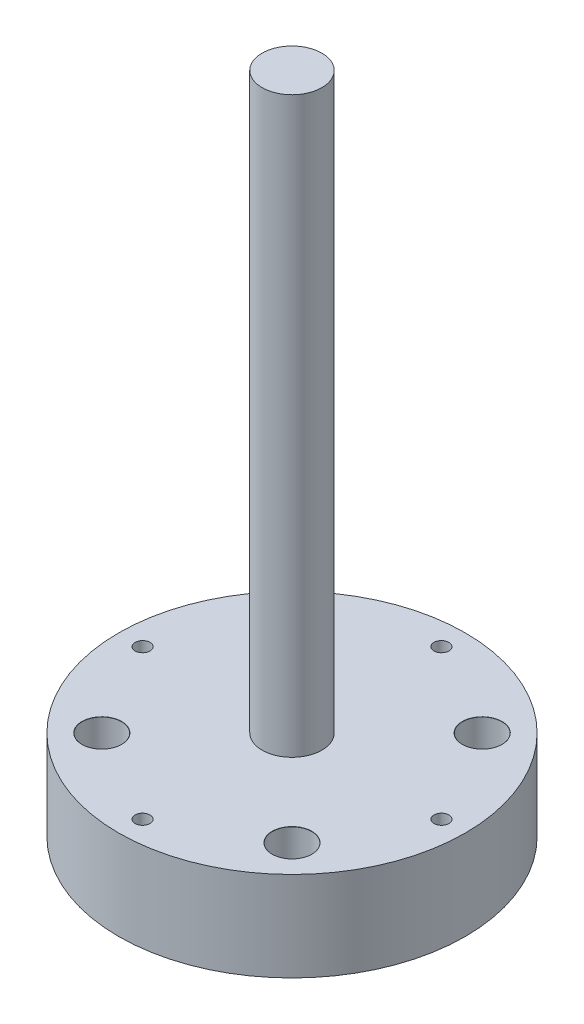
ISO-10303-21;
HEADER;
FILE_DESCRIPTION(('STEP AP214'),'2;1');
FILE_NAME('part.step','',(''),(''),'','','');
FILE_SCHEMA(('AUTOMOTIVE_DESIGN { 1 0 10303 214 1 1 1 1 }'));
ENDSEC;
DATA;
#1=APPLICATION_CONTEXT('core data for automotive mechanical design processes');
#2=APPLICATION_PROTOCOL_DEFINITION('international standard','automotive_design',2000,#1);
#3=PRODUCT_CONTEXT('',#1,'mechanical');
#4=PRODUCT('Part','Part','',(#3));
#5=PRODUCT_RELATED_PRODUCT_CATEGORY('part','',(#4));
#6=PRODUCT_DEFINITION_FORMATION('','',#4);
#7=PRODUCT_DEFINITION_CONTEXT('part definition',#1,'design');
#8=PRODUCT_DEFINITION('design','',#6,#7);
#9=PRODUCT_DEFINITION_SHAPE('','',#8);
#10=(LENGTH_UNIT() NAMED_UNIT(*) SI_UNIT(.MILLI.,.METRE.));
#11=(NAMED_UNIT(*) PLANE_ANGLE_UNIT() SI_UNIT($,.RADIAN.));
#12=(NAMED_UNIT(*) SI_UNIT($,.STERADIAN.) SOLID_ANGLE_UNIT());
#13=UNCERTAINTY_MEASURE_WITH_UNIT(LENGTH_MEASURE(1.E-05),#10,'distance_accuracy_value','');
#14=(GEOMETRIC_REPRESENTATION_CONTEXT(3) GLOBAL_UNCERTAINTY_ASSIGNED_CONTEXT((#13)) GLOBAL_UNIT_ASSIGNED_CONTEXT((#10,
#11,#12)) REPRESENTATION_CONTEXT('',''));
#15=CARTESIAN_POINT('',(0.,0.,0.));
#16=DIRECTION('',(0.,0.,1.));
#17=DIRECTION('',(1.,0.,0.));
#18=AXIS2_PLACEMENT_3D('',#15,#16,#17);
#19=CARTESIAN_POINT('',(0.,0.,0.));
#20=DIRECTION('',(0.,-1.,0.));
#21=DIRECTION('',(0.,0.,-1.));
#22=AXIS2_PLACEMENT_3D('',#19,#20,#21);
#23=CYLINDRICAL_SURFACE('',#22,21.);
#24=DIRECTION('',(0.,-1.,0.));
#25=VECTOR('',#24,1.);
#26=CARTESIAN_POINT('',(-10.8213564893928,4.4125,17.9971732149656));
#27=LINE('',#26,#25);
#28=CARTESIAN_POINT('',(-10.8213564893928,2.,17.9971732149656));
#29=VERTEX_POINT('',#28);
#30=CARTESIAN_POINT('',(-10.8213564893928,0.0250000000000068,17.9971732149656));
#31=VERTEX_POINT('',#30);
#32=EDGE_CURVE('E25',#29,#31,#27,.T.);
#33=ORIENTED_EDGE('',*,*,#32,.F.);
#34=CARTESIAN_POINT('',(0.,2.,0.));
#35=DIRECTION('',(0.,-1.,0.));
#36=DIRECTION('',(0.,0.,-1.));
#37=AXIS2_PLACEMENT_3D('',#34,#35,#36);
#38=CIRCLE('',#37,21.);
#39=CARTESIAN_POINT('',(10.8213564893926,2.,17.9971732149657));
#40=VERTEX_POINT('',#39);
#41=EDGE_CURVE('E255',#40,#29,#38,.T.);
#42=ORIENTED_EDGE('',*,*,#41,.F.);
#43=DIRECTION('',(0.,-1.,0.));
#44=VECTOR('',#43,1.);
#45=CARTESIAN_POINT('',(10.8213564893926,4.4125,17.9971732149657));
#46=LINE('',#45,#44);
#47=CARTESIAN_POINT('',(10.8213564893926,0.0250000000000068,17.9971732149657));
#48=VERTEX_POINT('',#47);
#49=EDGE_CURVE('E220',#48,#40,#46,.F.);
#50=ORIENTED_EDGE('',*,*,#49,.F.);
#51=CARTESIAN_POINT('',(10.7995028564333,-0.000200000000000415,18.0102953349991));
#52=CARTESIAN_POINT('',(10.8031751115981,0.00403364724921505,18.0080933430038));
#53=CARTESIAN_POINT('',(10.8068468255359,0.0082671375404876,18.005890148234));
#54=CARTESIAN_POINT('',(10.8141891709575,0.0167338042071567,18.0014813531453));
#55=CARTESIAN_POINT('',(10.8178598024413,0.0209669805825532,17.9992757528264));
#56=CARTESIAN_POINT('',(10.821529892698,0.0252000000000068,17.997068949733));
#57=B_SPLINE_CURVE_WITH_KNOTS('',3,(#51,#52,#53,#54,#55,#56),.UNSPECIFIED.,.F.,.F.,(4,2,4),(0.,
0.0180643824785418,0.0361287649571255),.UNSPECIFIED.);
#58=CARTESIAN_POINT('',(10.7996763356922,0.,18.0101913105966));
#59=VERTEX_POINT('',#58);
#60=EDGE_CURVE('E233',#59,#48,#57,.T.);
#61=ORIENTED_EDGE('',*,*,#60,.F.);
#62=CARTESIAN_POINT('',(0.,0.,0.));
#63=DIRECTION('',(0.,-1.,0.));
#64=DIRECTION('',(0.,0.,-1.));
#65=AXIS2_PLACEMENT_3D('',#62,#63,#64);
#66=CIRCLE('',#65,21.);
#67=CARTESIAN_POINT('',(-10.7996763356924,0.,18.0101913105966));
#68=VERTEX_POINT('',#67);
#69=EDGE_CURVE('E123',#59,#68,#66,.T.);
#70=ORIENTED_EDGE('',*,*,#69,.T.);
#71=CARTESIAN_POINT('',(-10.8215298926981,0.0251999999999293,17.9970689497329));
#72=CARTESIAN_POINT('',(-10.8178598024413,0.0209669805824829,17.9992757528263));
#73=CARTESIAN_POINT('',(-10.8141891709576,0.0167338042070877,18.0014813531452));
#74=CARTESIAN_POINT('',(-10.806846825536,0.00826713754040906,18.0058901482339));
#75=CARTESIAN_POINT('',(-10.8031751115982,0.00403364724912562,18.0080933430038));
#76=CARTESIAN_POINT('',(-10.7995028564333,-0.000200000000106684,18.010295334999));
#77=B_SPLINE_CURVE_WITH_KNOTS('',3,(#71,#72,#73,#74,#75,#76),.UNSPECIFIED.,.F.,.F.,(4,2,4),(0.,
0.0180643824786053,0.0361287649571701),.UNSPECIFIED.);
#78=EDGE_CURVE('E115',#31,#68,#77,.T.);
#79=ORIENTED_EDGE('',*,*,#78,.F.);
#80=EDGE_LOOP('',(#33,#42,#50,#61,#70,#79));
#81=FACE_BOUND('',#80,.T.);
#82=ADVANCED_FACE('F16',(#81),#23,.F.);
#83=DIRECTION('',(0.,-1.,0.));
#84=VECTOR('',#83,1.);
#85=CARTESIAN_POINT('',(10.8213564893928,4.4125,-17.9971732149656));
#86=LINE('',#85,#84);
#87=CARTESIAN_POINT('',(10.8213564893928,2.,-17.9971732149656));
#88=VERTEX_POINT('',#87);
#89=CARTESIAN_POINT('',(10.8213564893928,0.0250000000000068,-17.9971732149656));
#90=VERTEX_POINT('',#89);
#91=EDGE_CURVE('E148',#88,#90,#86,.T.);
#92=ORIENTED_EDGE('',*,*,#91,.F.);
#93=CARTESIAN_POINT('',(-10.8213564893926,2.,-17.9971732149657));
#94=VERTEX_POINT('',#93);
#95=EDGE_CURVE('E258',#94,#88,#38,.T.);
#96=ORIENTED_EDGE('',*,*,#95,.F.);
#97=DIRECTION('',(0.,-1.,0.));
#98=VECTOR('',#97,1.);
#99=CARTESIAN_POINT('',(-10.8213564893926,4.4125,-17.9971732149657));
#100=LINE('',#99,#98);
#101=CARTESIAN_POINT('',(-10.8213564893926,0.0250000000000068,-17.9971732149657));
#102=VERTEX_POINT('',#101);
#103=EDGE_CURVE('E188',#102,#94,#100,.F.);
#104=ORIENTED_EDGE('',*,*,#103,.F.);
#105=CARTESIAN_POINT('',(-10.7995028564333,-0.000200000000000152,-18.0102953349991));
#106=CARTESIAN_POINT('',(-10.8031751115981,0.00403364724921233,-18.0080933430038));
#107=CARTESIAN_POINT('',(-10.8068468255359,0.0082671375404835,-18.005890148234));
#108=CARTESIAN_POINT('',(-10.8141891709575,0.0167338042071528,-18.0014813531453));
#109=CARTESIAN_POINT('',(-10.8178598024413,0.0209669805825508,-17.9992757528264));
#110=CARTESIAN_POINT('',(-10.821529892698,0.0252000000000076,-17.997068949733));
#111=B_SPLINE_CURVE_WITH_KNOTS('',3,(#105,#106,#107,#108,#109,#110),.UNSPECIFIED.,.F.,.F.,(4,2,
4),(0.,0.0180643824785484,0.0361287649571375),.UNSPECIFIED.);
#112=CARTESIAN_POINT('',(-10.7996763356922,0.,-18.0101913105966));
#113=VERTEX_POINT('',#112);
#114=EDGE_CURVE('E201',#113,#102,#111,.T.);
#115=ORIENTED_EDGE('',*,*,#114,.F.);
#116=CARTESIAN_POINT('',(10.7996763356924,0.,-18.0101913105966));
#117=VERTEX_POINT('',#116);
#118=EDGE_CURVE('E241',#113,#117,#66,.T.);
#119=ORIENTED_EDGE('',*,*,#118,.T.);
#120=CARTESIAN_POINT('',(10.8215298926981,0.0251999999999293,-17.9970689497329));
#121=CARTESIAN_POINT('',(10.8178598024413,0.0209669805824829,-17.9992757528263));
#122=CARTESIAN_POINT('',(10.8141891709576,0.0167338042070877,-18.0014813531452));
#123=CARTESIAN_POINT('',(10.806846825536,0.00826713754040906,-18.0058901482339));
#124=CARTESIAN_POINT('',(10.8031751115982,0.00403364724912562,-18.0080933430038));
#125=CARTESIAN_POINT('',(10.7995028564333,-0.000200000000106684,-18.010295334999));
#126=B_SPLINE_CURVE_WITH_KNOTS('',3,(#120,#121,#122,#123,#124,#125),.UNSPECIFIED.,.F.,.F.,(4,2,
4),(0.,0.0180643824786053,0.0361287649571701),.UNSPECIFIED.);
#127=EDGE_CURVE('E150',#90,#117,#126,.T.);
#128=ORIENTED_EDGE('',*,*,#127,.F.);
#129=EDGE_LOOP('',(#92,#96,#104,#115,#119,#128));
#130=FACE_BOUND('',#129,.T.);
#131=ADVANCED_FACE('F388',(#130),#23,.F.);
#132=DIRECTION('',(0.,-1.,0.));
#133=VECTOR('',#132,1.);
#134=CARTESIAN_POINT('',(-17.9971732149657,4.4125,10.8213564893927));
#135=LINE('',#134,#133);
#136=CARTESIAN_POINT('',(-17.9971732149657,0.0250000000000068,10.8213564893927));
#137=VERTEX_POINT('',#136);
#138=CARTESIAN_POINT('',(-17.9971732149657,2.,10.8213564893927));
#139=VERTEX_POINT('',#138);
#140=EDGE_CURVE('E124',#137,#139,#135,.F.);
#141=ORIENTED_EDGE('',*,*,#140,.F.);
#142=CARTESIAN_POINT('',(-18.010295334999,-0.000200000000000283,10.7995028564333));
#143=CARTESIAN_POINT('',(-18.0080933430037,0.00403364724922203,10.8031751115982));
#144=CARTESIAN_POINT('',(-18.0058901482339,0.00826713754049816,10.806846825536));
#145=CARTESIAN_POINT('',(-18.0014813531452,0.0167338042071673,10.8141891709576));
#146=CARTESIAN_POINT('',(-17.9992757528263,0.0209669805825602,10.8178598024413));
#147=CARTESIAN_POINT('',(-17.9970689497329,0.025200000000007,10.8215298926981));
#148=B_SPLINE_CURVE_WITH_KNOTS('',3,(#142,#143,#144,#145,#146,#147),.UNSPECIFIED.,.F.,.F.,(4,2,
4),(0.,0.0180643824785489,0.0361287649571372),.UNSPECIFIED.);
#149=CARTESIAN_POINT('',(-18.0101913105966,0.,10.7996763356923));
#150=VERTEX_POINT('',#149);
#151=EDGE_CURVE('E117',#150,#137,#148,.T.);
#152=ORIENTED_EDGE('',*,*,#151,.F.);
#153=CARTESIAN_POINT('',(-18.0101913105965,0.,-10.7996763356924));
#154=VERTEX_POINT('',#153);
#155=EDGE_CURVE('E240',#150,#154,#66,.T.);
#156=ORIENTED_EDGE('',*,*,#155,.T.);
#157=CARTESIAN_POINT('',(-17.9970689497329,0.0251999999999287,-10.8215298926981));
#158=CARTESIAN_POINT('',(-17.9992757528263,0.0209669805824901,-10.8178598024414));
#159=CARTESIAN_POINT('',(-18.0014813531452,0.0167338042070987,-10.8141891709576));
#160=CARTESIAN_POINT('',(-18.0058901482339,0.00826713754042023,-10.806846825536));
#161=CARTESIAN_POINT('',(-18.0080933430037,0.00403364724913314,-10.8031751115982));
#162=CARTESIAN_POINT('',(-18.010295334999,-0.000200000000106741,-10.7995028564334));
#163=B_SPLINE_CURVE_WITH_KNOTS('',3,(#157,#158,#159,#160,#161,#162),.UNSPECIFIED.,.F.,.F.,(4,2,
4),(0.,0.0180643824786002,0.0361287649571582),.UNSPECIFIED.);
#164=CARTESIAN_POINT('',(-17.9971732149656,0.0250000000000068,-10.8213564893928));
#165=VERTEX_POINT('',#164);
#166=EDGE_CURVE('E180',#165,#154,#163,.T.);
#167=ORIENTED_EDGE('',*,*,#166,.F.);
#168=DIRECTION('',(0.,-1.,0.));
#169=VECTOR('',#168,1.);
#170=CARTESIAN_POINT('',(-17.9971732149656,4.4125,-10.8213564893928));
#171=LINE('',#170,#169);
#172=CARTESIAN_POINT('',(-17.9971732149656,2.,-10.8213564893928));
#173=VERTEX_POINT('',#172);
#174=EDGE_CURVE('E178',#173,#165,#171,.T.);
#175=ORIENTED_EDGE('',*,*,#174,.F.);
#176=EDGE_CURVE('E257',#139,#173,#38,.T.);
#177=ORIENTED_EDGE('',*,*,#176,.F.);
#178=EDGE_LOOP('',(#141,#152,#156,#167,#175,#177));
#179=FACE_BOUND('',#178,.T.);
#180=ADVANCED_FACE('F393',(#179),#23,.F.);
#181=DIRECTION('',(0.,-1.,0.));
#182=VECTOR('',#181,1.);
#183=CARTESIAN_POINT('',(17.9971732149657,4.4125,-10.8213564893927));
#184=LINE('',#183,#182);
#185=CARTESIAN_POINT('',(17.9971732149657,0.0250000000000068,-10.8213564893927));
#186=VERTEX_POINT('',#185);
#187=CARTESIAN_POINT('',(17.9971732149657,2.,-10.8213564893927));
#188=VERTEX_POINT('',#187);
#189=EDGE_CURVE('E157',#186,#188,#184,.F.);
#190=ORIENTED_EDGE('',*,*,#189,.F.);
#191=CARTESIAN_POINT('',(18.010295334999,-0.000200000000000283,-10.7995028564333));
#192=CARTESIAN_POINT('',(18.0080933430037,0.00403364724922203,-10.8031751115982));
#193=CARTESIAN_POINT('',(18.0058901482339,0.00826713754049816,-10.806846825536));
#194=CARTESIAN_POINT('',(18.0014813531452,0.0167338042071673,-10.8141891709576));
#195=CARTESIAN_POINT('',(17.9992757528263,0.0209669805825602,-10.8178598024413));
#196=CARTESIAN_POINT('',(17.9970689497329,0.025200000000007,-10.8215298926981));
#197=B_SPLINE_CURVE_WITH_KNOTS('',3,(#191,#192,#193,#194,#195,#196),.UNSPECIFIED.,.F.,.F.,(4,2,
4),(0.,0.0180643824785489,0.0361287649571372),.UNSPECIFIED.);
#198=CARTESIAN_POINT('',(18.0101913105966,0.,-10.7996763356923));
#199=VERTEX_POINT('',#198);
#200=EDGE_CURVE('E169',#199,#186,#197,.T.);
#201=ORIENTED_EDGE('',*,*,#200,.F.);
#202=CARTESIAN_POINT('',(18.0101913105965,0.,10.7996763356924));
#203=VERTEX_POINT('',#202);
#204=EDGE_CURVE('E245',#199,#203,#66,.T.);
#205=ORIENTED_EDGE('',*,*,#204,.T.);
#206=CARTESIAN_POINT('',(17.9970689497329,0.0251999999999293,10.8215298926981));
#207=CARTESIAN_POINT('',(17.9992757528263,0.0209669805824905,10.8178598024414));
#208=CARTESIAN_POINT('',(18.0014813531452,0.0167338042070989,10.8141891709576));
#209=CARTESIAN_POINT('',(18.0058901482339,0.00826713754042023,10.806846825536));
#210=CARTESIAN_POINT('',(18.0080933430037,0.00403364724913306,10.8031751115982));
#211=CARTESIAN_POINT('',(18.010295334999,-0.000200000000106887,10.7995028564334));
#212=B_SPLINE_CURVE_WITH_KNOTS('',3,(#206,#207,#208,#209,#210,#211),.UNSPECIFIED.,.F.,.F.,(4,2,
4),(0.,0.0180643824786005,0.0361287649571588),.UNSPECIFIED.);
#213=CARTESIAN_POINT('',(17.9971732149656,0.0250000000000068,10.8213564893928));
#214=VERTEX_POINT('',#213);
#215=EDGE_CURVE('E212',#214,#203,#212,.T.);
#216=ORIENTED_EDGE('',*,*,#215,.F.);
#217=DIRECTION('',(0.,-1.,0.));
#218=VECTOR('',#217,1.);
#219=CARTESIAN_POINT('',(17.9971732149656,4.4125,10.8213564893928));
#220=LINE('',#219,#218);
#221=CARTESIAN_POINT('',(17.9971732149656,2.,10.8213564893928));
#222=VERTEX_POINT('',#221);
#223=EDGE_CURVE('E210',#222,#214,#220,.T.);
#224=ORIENTED_EDGE('',*,*,#223,.F.);
#225=EDGE_CURVE('E262',#188,#222,#38,.T.);
#226=ORIENTED_EDGE('',*,*,#225,.F.);
#227=EDGE_LOOP('',(#190,#201,#205,#216,#224,#226));
#228=FACE_BOUND('',#227,.T.);
#229=ADVANCED_FACE('F18',(#228),#23,.F.);
#230=CARTESIAN_POINT('',(21.,0.,0.));
#231=DIRECTION('',(0.,-1.,0.));
#232=DIRECTION('',(0.,0.,-1.));
#233=AXIS2_PLACEMENT_3D('',#230,#231,#232);
#234=PLANE('',#233);
#235=CARTESIAN_POINT('',(0.,0.,25.));
#236=DIRECTION('',(0.,-1.,0.));
#237=DIRECTION('',(0.,0.,-1.));
#238=AXIS2_PLACEMENT_3D('',#235,#236,#237);
#239=CIRCLE('',#238,1.25);
#240=CARTESIAN_POINT('',(0.,0.,23.75));
#241=VERTEX_POINT('',#240);
#242=EDGE_CURVE('E355',#241,#241,#239,.T.);
#243=ORIENTED_EDGE('',*,*,#242,.F.);
#244=EDGE_LOOP('',(#243));
#245=FACE_BOUND('',#244,.T.);
#246=CARTESIAN_POINT('',(0.,0.,-25.));
#247=DIRECTION('',(0.,-1.,0.));
#248=DIRECTION('',(0.,0.,-1.));
#249=AXIS2_PLACEMENT_3D('',#246,#247,#248);
#250=CIRCLE('',#249,1.25);
#251=CARTESIAN_POINT('',(0.,0.,-26.25));
#252=VERTEX_POINT('',#251);
#253=EDGE_CURVE('E349',#252,#252,#250,.T.);
#254=ORIENTED_EDGE('',*,*,#253,.F.);
#255=EDGE_LOOP('',(#254));
#256=FACE_BOUND('',#255,.T.);
#257=CARTESIAN_POINT('',(-25.,0.,0.));
#258=DIRECTION('',(0.,-1.,0.));
#259=DIRECTION('',(0.,0.,-1.));
#260=AXIS2_PLACEMENT_3D('',#257,#258,#259);
#261=CIRCLE('',#260,1.25);
#262=CARTESIAN_POINT('',(-25.,0.,-1.25));
#263=VERTEX_POINT('',#262);
#264=EDGE_CURVE('E343',#263,#263,#261,.T.);
#265=ORIENTED_EDGE('',*,*,#264,.F.);
#266=EDGE_LOOP('',(#265));
#267=FACE_BOUND('',#266,.T.);
#268=CARTESIAN_POINT('',(25.,0.,0.));
#269=DIRECTION('',(0.,-1.,0.));
#270=DIRECTION('',(0.,0.,-1.));
#271=AXIS2_PLACEMENT_3D('',#268,#269,#270);
#272=CIRCLE('',#271,1.25);
#273=CARTESIAN_POINT('',(25.,0.,-1.24999999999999));
#274=VERTEX_POINT('',#273);
#275=EDGE_CURVE('E337',#274,#274,#272,.T.);
#276=ORIENTED_EDGE('',*,*,#275,.F.);
#277=EDGE_LOOP('',(#276));
#278=FACE_BOUND('',#277,.T.);
#279=CARTESIAN_POINT('',(-15.9099025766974,0.,15.9099025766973));
#280=DIRECTION('',(0.,-1.,0.));
#281=DIRECTION('',(0.,0.,-1.));
#282=AXIS2_PLACEMENT_3D('',#279,#280,#281);
#283=CIRCLE('',#282,5.525);
#284=EDGE_CURVE('E32',#68,#150,#283,.T.);
#285=ORIENTED_EDGE('',*,*,#284,.F.);
#286=ORIENTED_EDGE('',*,*,#69,.F.);
#287=CARTESIAN_POINT('',(15.9099025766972,0.,15.9099025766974));
#288=DIRECTION('',(0.,-1.,0.));
#289=DIRECTION('',(0.,0.,-1.));
#290=AXIS2_PLACEMENT_3D('',#287,#288,#289);
#291=CIRCLE('',#290,5.525);
#292=EDGE_CURVE('E275',#203,#59,#291,.T.);
#293=ORIENTED_EDGE('',*,*,#292,.F.);
#294=ORIENTED_EDGE('',*,*,#204,.F.);
#295=CARTESIAN_POINT('',(15.9099025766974,0.,-15.9099025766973));
#296=DIRECTION('',(0.,-1.,0.));
#297=DIRECTION('',(0.,0.,-1.));
#298=AXIS2_PLACEMENT_3D('',#295,#296,#297);
#299=CIRCLE('',#298,5.525);
#300=EDGE_CURVE('E40',#117,#199,#299,.T.);
#301=ORIENTED_EDGE('',*,*,#300,.F.);
#302=ORIENTED_EDGE('',*,*,#118,.F.);
#303=CARTESIAN_POINT('',(-15.9099025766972,0.,-15.9099025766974));
#304=DIRECTION('',(0.,-1.,0.));
#305=DIRECTION('',(0.,0.,-1.));
#306=AXIS2_PLACEMENT_3D('',#303,#304,#305);
#307=CIRCLE('',#306,5.525);
#308=EDGE_CURVE('E295',#154,#113,#307,.T.);
#309=ORIENTED_EDGE('',*,*,#308,.F.);
#310=ORIENTED_EDGE('',*,*,#155,.F.);
#311=EDGE_LOOP('',(#285,#286,#293,#294,#301,#302,#309,#310));
#312=FACE_BOUND('',#311,.T.);
#313=CARTESIAN_POINT('',(0.,0.,0.));
#314=DIRECTION('',(0.,-1.,0.));
#315=DIRECTION('',(0.,0.,-1.));
#316=AXIS2_PLACEMENT_3D('',#313,#314,#315);
#317=CIRCLE('',#316,29.);
#318=CARTESIAN_POINT('',(0.,0.,-29.));
#319=VERTEX_POINT('',#318);
#320=EDGE_CURVE('E242',#319,#319,#317,.T.);
#321=ORIENTED_EDGE('',*,*,#320,.T.);
#322=EDGE_LOOP('',(#321));
#323=FACE_BOUND('',#322,.T.);
#324=ADVANCED_FACE('F361',(#245,#256,#267,#278,#312,#323),#234,.T.);
#325=CARTESIAN_POINT('',(0.,0.,0.));
#326=DIRECTION('',(0.,-1.,0.));
#327=DIRECTION('',(0.,0.,-1.));
#328=AXIS2_PLACEMENT_3D('',#325,#326,#327);
#329=CYLINDRICAL_SURFACE('',#328,29.);
#330=CARTESIAN_POINT('',(0.,15.,0.));
#331=DIRECTION('',(0.,-1.,0.));
#332=DIRECTION('',(0.,0.,-1.));
#333=AXIS2_PLACEMENT_3D('',#330,#331,#332);
#334=CIRCLE('',#333,29.);
#335=CARTESIAN_POINT('',(0.,15.,-29.));
#336=VERTEX_POINT('',#335);
#337=EDGE_CURVE('E246',#336,#336,#334,.T.);
#338=ORIENTED_EDGE('',*,*,#337,.T.);
#339=EDGE_LOOP('',(#338));
#340=FACE_BOUND('',#339,.T.);
#341=ORIENTED_EDGE('',*,*,#320,.F.);
#342=EDGE_LOOP('',(#341));
#343=FACE_BOUND('',#342,.T.);
#344=ADVANCED_FACE('F364',(#340,#343),#329,.T.);
#345=CARTESIAN_POINT('',(29.,15.,0.));
#346=DIRECTION('',(0.,1.,0.));
#347=DIRECTION('',(0.,0.,1.));
#348=AXIS2_PLACEMENT_3D('',#345,#346,#347);
#349=PLANE('',#348);
#350=CARTESIAN_POINT('',(0.,15.,25.));
#351=DIRECTION('',(0.,1.,0.));
#352=DIRECTION('',(0.,0.,1.));
#353=AXIS2_PLACEMENT_3D('',#350,#351,#352);
#354=CIRCLE('',#353,1.25);
#355=CARTESIAN_POINT('',(0.,15.,26.25));
#356=VERTEX_POINT('',#355);
#357=EDGE_CURVE('E352',#356,#356,#354,.T.);
#358=ORIENTED_EDGE('',*,*,#357,.F.);
#359=EDGE_LOOP('',(#358));
#360=FACE_BOUND('',#359,.T.);
#361=CARTESIAN_POINT('',(0.,15.,-25.));
#362=DIRECTION('',(0.,1.,0.));
#363=DIRECTION('',(0.,0.,1.));
#364=AXIS2_PLACEMENT_3D('',#361,#362,#363);
#365=CIRCLE('',#364,1.25);
#366=CARTESIAN_POINT('',(0.,15.,-23.75));
#367=VERTEX_POINT('',#366);
#368=EDGE_CURVE('E346',#367,#367,#365,.T.);
#369=ORIENTED_EDGE('',*,*,#368,.F.);
#370=EDGE_LOOP('',(#369));
#371=FACE_BOUND('',#370,.T.);
#372=CARTESIAN_POINT('',(-25.,15.,0.));
#373=DIRECTION('',(0.,1.,0.));
#374=DIRECTION('',(0.,0.,1.));
#375=AXIS2_PLACEMENT_3D('',#372,#373,#374);
#376=CIRCLE('',#375,1.25);
#377=CARTESIAN_POINT('',(-25.,15.,1.25));
#378=VERTEX_POINT('',#377);
#379=EDGE_CURVE('E340',#378,#378,#376,.T.);
#380=ORIENTED_EDGE('',*,*,#379,.F.);
#381=EDGE_LOOP('',(#380));
#382=FACE_BOUND('',#381,.T.);
#383=CARTESIAN_POINT('',(25.,15.,0.));
#384=DIRECTION('',(0.,1.,0.));
#385=DIRECTION('',(0.,0.,1.));
#386=AXIS2_PLACEMENT_3D('',#383,#384,#385);
#387=CIRCLE('',#386,1.25);
#388=CARTESIAN_POINT('',(25.,15.,1.25000000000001));
#389=VERTEX_POINT('',#388);
#390=EDGE_CURVE('E334',#389,#389,#387,.T.);
#391=ORIENTED_EDGE('',*,*,#390,.F.);
#392=EDGE_LOOP('',(#391));
#393=FACE_BOUND('',#392,.T.);
#394=CARTESIAN_POINT('',(-15.9099025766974,15.,15.9099025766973));
#395=DIRECTION('',(0.,-1.,0.));
#396=DIRECTION('',(0.,0.,-1.));
#397=AXIS2_PLACEMENT_3D('',#394,#395,#396);
#398=CIRCLE('',#397,3.325);
#399=CARTESIAN_POINT('',(-15.9099025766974,15.,12.5849025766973));
#400=VERTEX_POINT('',#399);
#401=EDGE_CURVE('E331',#400,#400,#398,.T.);
#402=ORIENTED_EDGE('',*,*,#401,.T.);
#403=EDGE_LOOP('',(#402));
#404=FACE_BOUND('',#403,.T.);
#405=CARTESIAN_POINT('',(15.9099025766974,15.,-15.9099025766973));
#406=DIRECTION('',(0.,-1.,0.));
#407=DIRECTION('',(0.,0.,-1.));
#408=AXIS2_PLACEMENT_3D('',#405,#406,#407);
#409=CIRCLE('',#408,3.325);
#410=CARTESIAN_POINT('',(15.9099025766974,15.,-19.2349025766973));
#411=VERTEX_POINT('',#410);
#412=EDGE_CURVE('E316',#411,#411,#409,.T.);
#413=ORIENTED_EDGE('',*,*,#412,.T.);
#414=EDGE_LOOP('',(#413));
#415=FACE_BOUND('',#414,.T.);
#416=CARTESIAN_POINT('',(-15.9099025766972,15.,-15.9099025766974));
#417=DIRECTION('',(0.,-1.,0.));
#418=DIRECTION('',(0.,0.,-1.));
#419=AXIS2_PLACEMENT_3D('',#416,#417,#418);
#420=CIRCLE('',#419,3.325);
#421=CARTESIAN_POINT('',(-15.9099025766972,15.,-19.2349025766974));
#422=VERTEX_POINT('',#421);
#423=EDGE_CURVE('E297',#422,#422,#420,.T.);
#424=ORIENTED_EDGE('',*,*,#423,.T.);
#425=EDGE_LOOP('',(#424));
#426=FACE_BOUND('',#425,.T.);
#427=CARTESIAN_POINT('',(15.9099025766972,15.,15.9099025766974));
#428=DIRECTION('',(0.,-1.,0.));
#429=DIRECTION('',(0.,0.,-1.));
#430=AXIS2_PLACEMENT_3D('',#427,#428,#429);
#431=CIRCLE('',#430,3.325);
#432=CARTESIAN_POINT('',(15.9099025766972,15.,12.5849025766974));
#433=VERTEX_POINT('',#432);
#434=EDGE_CURVE('E277',#433,#433,#431,.T.);
#435=ORIENTED_EDGE('',*,*,#434,.T.);
#436=EDGE_LOOP('',(#435));
#437=FACE_BOUND('',#436,.T.);
#438=CARTESIAN_POINT('',(0.,15.,0.));
#439=DIRECTION('',(0.,-1.,0.));
#440=DIRECTION('',(0.,0.,-1.));
#441=AXIS2_PLACEMENT_3D('',#438,#439,#440);
#442=CIRCLE('',#441,5.);
#443=CARTESIAN_POINT('',(0.,15.,-5.));
#444=VERTEX_POINT('',#443);
#445=EDGE_CURVE('E249',#444,#444,#442,.T.);
#446=ORIENTED_EDGE('',*,*,#445,.T.);
#447=EDGE_LOOP('',(#446));
#448=FACE_BOUND('',#447,.T.);
#449=ORIENTED_EDGE('',*,*,#337,.F.);
#450=EDGE_LOOP('',(#449));
#451=FACE_BOUND('',#450,.T.);
#452=ADVANCED_FACE('F376',(#360,#371,#382,#393,#404,#415,#426,#437,#448,#451),#349,.T.);
#453=CARTESIAN_POINT('',(0.,0.,0.));
#454=DIRECTION('',(0.,-1.,0.));
#455=DIRECTION('',(0.,0.,-1.));
#456=AXIS2_PLACEMENT_3D('',#453,#454,#455);
#457=CYLINDRICAL_SURFACE('',#456,5.);
#458=CARTESIAN_POINT('',(0.,111.,0.));
#459=DIRECTION('',(0.,-1.,0.));
#460=DIRECTION('',(0.,0.,-1.));
#461=AXIS2_PLACEMENT_3D('',#458,#459,#460);
#462=CIRCLE('',#461,5.);
#463=CARTESIAN_POINT('',(0.,111.,-5.));
#464=VERTEX_POINT('',#463);
#465=EDGE_CURVE('E252',#464,#464,#462,.T.);
#466=ORIENTED_EDGE('',*,*,#465,.T.);
#467=EDGE_LOOP('',(#466));
#468=FACE_BOUND('',#467,.T.);
#469=ORIENTED_EDGE('',*,*,#445,.F.);
#470=EDGE_LOOP('',(#469));
#471=FACE_BOUND('',#470,.T.);
#472=ADVANCED_FACE('F384',(#468,#471),#457,.T.);
#473=CARTESIAN_POINT('',(5.,111.,0.));
#474=DIRECTION('',(0.,1.,0.));
#475=DIRECTION('',(0.,0.,1.));
#476=AXIS2_PLACEMENT_3D('',#473,#474,#475);
#477=PLANE('',#476);
#478=ORIENTED_EDGE('',*,*,#465,.F.);
#479=EDGE_LOOP('',(#478));
#480=FACE_BOUND('',#479,.T.);
#481=ADVANCED_FACE('F460',(#480),#477,.T.);
#482=CARTESIAN_POINT('',(21.,2.,0.));
#483=DIRECTION('',(0.,-1.,0.));
#484=DIRECTION('',(0.,0.,-1.));
#485=AXIS2_PLACEMENT_3D('',#482,#483,#484);
#486=PLANE('',#485);
#487=CARTESIAN_POINT('',(-15.9099025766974,2.,15.9099025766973));
#488=DIRECTION('',(0.,-1.,0.));
#489=DIRECTION('',(0.,0.,-1.));
#490=AXIS2_PLACEMENT_3D('',#487,#488,#489);
#491=CIRCLE('',#490,5.5);
#492=EDGE_CURVE('E11',#139,#29,#491,.T.);
#493=ORIENTED_EDGE('',*,*,#492,.F.);
#494=ORIENTED_EDGE('',*,*,#176,.T.);
#495=CARTESIAN_POINT('',(-15.9099025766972,2.,-15.9099025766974));
#496=DIRECTION('',(0.,-1.,0.));
#497=DIRECTION('',(0.,0.,-1.));
#498=AXIS2_PLACEMENT_3D('',#495,#496,#497);
#499=CIRCLE('',#498,5.5);
#500=EDGE_CURVE('E175',#94,#173,#499,.T.);
#501=ORIENTED_EDGE('',*,*,#500,.F.);
#502=ORIENTED_EDGE('',*,*,#95,.T.);
#503=CARTESIAN_POINT('',(15.9099025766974,2.,-15.9099025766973));
#504=DIRECTION('',(0.,-1.,0.));
#505=DIRECTION('',(0.,0.,-1.));
#506=AXIS2_PLACEMENT_3D('',#503,#504,#505);
#507=CIRCLE('',#506,5.5);
#508=EDGE_CURVE('E146',#188,#88,#507,.T.);
#509=ORIENTED_EDGE('',*,*,#508,.F.);
#510=ORIENTED_EDGE('',*,*,#225,.T.);
#511=CARTESIAN_POINT('',(15.9099025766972,2.,15.9099025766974));
#512=DIRECTION('',(0.,-1.,0.));
#513=DIRECTION('',(0.,0.,-1.));
#514=AXIS2_PLACEMENT_3D('',#511,#512,#513);
#515=CIRCLE('',#514,5.5);
#516=EDGE_CURVE('E207',#40,#222,#515,.T.);
#517=ORIENTED_EDGE('',*,*,#516,.F.);
#518=ORIENTED_EDGE('',*,*,#41,.T.);
#519=EDGE_LOOP('',(#493,#494,#501,#502,#509,#510,#517,#518));
#520=FACE_BOUND('',#519,.T.);
#521=ADVANCED_FACE('F413',(#520),#486,.T.);
#522=CARTESIAN_POINT('',(15.9099025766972,14.975,15.9099025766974));
#523=DIRECTION('',(0.,1.,0.));
#524=DIRECTION('',(0.,0.,1.));
#525=AXIS2_PLACEMENT_3D('',#522,#523,#524);
#526=CONICAL_SURFACE('',#525,3.3,0.785398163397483);
#527=ORIENTED_EDGE('',*,*,#434,.F.);
#528=EDGE_LOOP('',(#527));
#529=FACE_BOUND('',#528,.T.);
#530=CARTESIAN_POINT('',(15.9099025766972,14.975,15.9099025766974));
#531=DIRECTION('',(0.,-1.,0.));
#532=DIRECTION('',(0.,0.,-1.));
#533=AXIS2_PLACEMENT_3D('',#530,#531,#532);
#534=CIRCLE('',#533,3.3);
#535=CARTESIAN_POINT('',(15.9099025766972,14.975,12.6099025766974));
#536=VERTEX_POINT('',#535);
#537=EDGE_CURVE('E259',#536,#536,#534,.T.);
#538=ORIENTED_EDGE('',*,*,#537,.T.);
#539=EDGE_LOOP('',(#538));
#540=FACE_BOUND('',#539,.T.);
#541=ADVANCED_FACE('F453',(#529,#540),#526,.F.);
#542=CARTESIAN_POINT('',(15.9099025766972,0.,15.9099025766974));
#543=DIRECTION('',(0.,-1.,0.));
#544=DIRECTION('',(0.,0.,-1.));
#545=AXIS2_PLACEMENT_3D('',#542,#543,#544);
#546=CYLINDRICAL_SURFACE('',#545,3.3);
#547=ORIENTED_EDGE('',*,*,#537,.F.);
#548=EDGE_LOOP('',(#547));
#549=FACE_BOUND('',#548,.T.);
#550=CARTESIAN_POINT('',(15.9099025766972,8.825,15.9099025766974));
#551=DIRECTION('',(0.,-1.,0.));
#552=DIRECTION('',(0.,0.,-1.));
#553=AXIS2_PLACEMENT_3D('',#550,#551,#552);
#554=CIRCLE('',#553,3.3);
#555=CARTESIAN_POINT('',(15.9099025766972,8.825,12.6099025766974));
#556=VERTEX_POINT('',#555);
#557=EDGE_CURVE('E263',#556,#556,#554,.T.);
#558=ORIENTED_EDGE('',*,*,#557,.T.);
#559=EDGE_LOOP('',(#558));
#560=FACE_BOUND('',#559,.T.);
#561=ADVANCED_FACE('F446',(#549,#560),#546,.F.);
#562=CARTESIAN_POINT('',(15.9099025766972,8.8,15.9099025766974));
#563=DIRECTION('',(0.,-1.,0.));
#564=DIRECTION('',(0.,0.,-1.));
#565=AXIS2_PLACEMENT_3D('',#562,#563,#564);
#566=CONICAL_SURFACE('',#565,3.325,0.785398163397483);
#567=ORIENTED_EDGE('',*,*,#557,.F.);
#568=EDGE_LOOP('',(#567));
#569=FACE_BOUND('',#568,.T.);
#570=CARTESIAN_POINT('',(15.9099025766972,8.8,15.9099025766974));
#571=DIRECTION('',(0.,-1.,0.));
#572=DIRECTION('',(0.,0.,-1.));
#573=AXIS2_PLACEMENT_3D('',#570,#571,#572);
#574=CIRCLE('',#573,3.325);
#575=CARTESIAN_POINT('',(15.9099025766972,8.8,12.5849025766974));
#576=VERTEX_POINT('',#575);
#577=EDGE_CURVE('E266',#576,#576,#574,.T.);
#578=ORIENTED_EDGE('',*,*,#577,.T.);
#579=EDGE_LOOP('',(#578));
#580=FACE_BOUND('',#579,.T.);
#581=ADVANCED_FACE('F440',(#569,#580),#566,.F.);
#582=CARTESIAN_POINT('',(19.2349025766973,8.8,15.9099025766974));
#583=DIRECTION('',(0.,1.,0.));
#584=DIRECTION('',(0.,0.,1.));
#585=AXIS2_PLACEMENT_3D('',#582,#583,#584);
#586=PLANE('',#585);
#587=ORIENTED_EDGE('',*,*,#577,.F.);
#588=EDGE_LOOP('',(#587));
#589=FACE_BOUND('',#588,.T.);
#590=CARTESIAN_POINT('',(15.9099025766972,8.8,15.9099025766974));
#591=DIRECTION('',(0.,-1.,0.));
#592=DIRECTION('',(0.,0.,-1.));
#593=AXIS2_PLACEMENT_3D('',#590,#591,#592);
#594=CIRCLE('',#593,5.5);
#595=CARTESIAN_POINT('',(15.9099025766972,8.8,10.4099025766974));
#596=VERTEX_POINT('',#595);
#597=EDGE_CURVE('E269',#596,#596,#594,.T.);
#598=ORIENTED_EDGE('',*,*,#597,.T.);
#599=EDGE_LOOP('',(#598));
#600=FACE_BOUND('',#599,.T.);
#601=ADVANCED_FACE('F436',(#589,#600),#586,.F.);
#602=CARTESIAN_POINT('',(15.9099025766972,0.,15.9099025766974));
#603=DIRECTION('',(0.,-1.,0.));
#604=DIRECTION('',(0.,0.,-1.));
#605=AXIS2_PLACEMENT_3D('',#602,#603,#604);
#606=CYLINDRICAL_SURFACE('',#605,5.5);
#607=ORIENTED_EDGE('',*,*,#49,.T.);
#608=ORIENTED_EDGE('',*,*,#516,.T.);
#609=ORIENTED_EDGE('',*,*,#223,.T.);
#610=CARTESIAN_POINT('',(15.9099025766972,0.0250000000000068,15.9099025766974));
#611=DIRECTION('',(0.,-1.,0.));
#612=DIRECTION('',(0.,0.,-1.));
#613=AXIS2_PLACEMENT_3D('',#610,#611,#612);
#614=CIRCLE('',#613,5.5);
#615=EDGE_CURVE('E272',#214,#48,#614,.T.);
#616=ORIENTED_EDGE('',*,*,#615,.T.);
#617=EDGE_LOOP('',(#607,#608,#609,#616));
#618=FACE_BOUND('',#617,.T.);
#619=ORIENTED_EDGE('',*,*,#597,.F.);
#620=EDGE_LOOP('',(#619));
#621=FACE_BOUND('',#620,.T.);
#622=ADVANCED_FACE('F228',(#618,#621),#606,.F.);
#623=CARTESIAN_POINT('',(15.9099025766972,0.,15.9099025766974));
#624=DIRECTION('',(0.,-1.,0.));
#625=DIRECTION('',(0.,0.,-1.));
#626=AXIS2_PLACEMENT_3D('',#623,#624,#625);
#627=CONICAL_SURFACE('',#626,5.525,0.785398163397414);
#628=ORIENTED_EDGE('',*,*,#215,.T.);
#629=ORIENTED_EDGE('',*,*,#292,.T.);
#630=ORIENTED_EDGE('',*,*,#60,.T.);
#631=ORIENTED_EDGE('',*,*,#615,.F.);
#632=EDGE_LOOP('',(#628,#629,#630,#631));
#633=FACE_BOUND('',#632,.T.);
#634=ADVANCED_FACE('F222',(#633),#627,.F.);
#635=CARTESIAN_POINT('',(-15.9099025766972,14.975,-15.9099025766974));
#636=DIRECTION('',(0.,1.,0.));
#637=DIRECTION('',(0.,0.,1.));
#638=AXIS2_PLACEMENT_3D('',#635,#636,#637);
#639=CONICAL_SURFACE('',#638,3.3,0.785398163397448);
#640=ORIENTED_EDGE('',*,*,#423,.F.);
#641=EDGE_LOOP('',(#640));
#642=FACE_BOUND('',#641,.T.);
#643=CARTESIAN_POINT('',(-15.9099025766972,14.975,-15.9099025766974));
#644=DIRECTION('',(0.,-1.,0.));
#645=DIRECTION('',(0.,0.,-1.));
#646=AXIS2_PLACEMENT_3D('',#643,#644,#645);
#647=CIRCLE('',#646,3.3);
#648=CARTESIAN_POINT('',(-15.9099025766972,14.975,-19.2099025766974));
#649=VERTEX_POINT('',#648);
#650=EDGE_CURVE('E280',#649,#649,#647,.T.);
#651=ORIENTED_EDGE('',*,*,#650,.T.);
#652=EDGE_LOOP('',(#651));
#653=FACE_BOUND('',#652,.T.);
#654=ADVANCED_FACE('F227',(#642,#653),#639,.F.);
#655=CARTESIAN_POINT('',(-15.9099025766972,0.,-15.9099025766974));
#656=DIRECTION('',(0.,-1.,0.));
#657=DIRECTION('',(0.,0.,-1.));
#658=AXIS2_PLACEMENT_3D('',#655,#656,#657);
#659=CYLINDRICAL_SURFACE('',#658,3.3);
#660=ORIENTED_EDGE('',*,*,#650,.F.);
#661=EDGE_LOOP('',(#660));
#662=FACE_BOUND('',#661,.T.);
#663=CARTESIAN_POINT('',(-15.9099025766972,8.825,-15.9099025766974));
#664=DIRECTION('',(0.,-1.,0.));
#665=DIRECTION('',(0.,0.,-1.));
#666=AXIS2_PLACEMENT_3D('',#663,#664,#665);
#667=CIRCLE('',#666,3.3);
#668=CARTESIAN_POINT('',(-15.9099025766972,8.825,-19.2099025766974));
#669=VERTEX_POINT('',#668);
#670=EDGE_CURVE('E283',#669,#669,#667,.T.);
#671=ORIENTED_EDGE('',*,*,#670,.T.);
#672=EDGE_LOOP('',(#671));
#673=FACE_BOUND('',#672,.T.);
#674=ADVANCED_FACE('F533',(#662,#673),#659,.F.);
#675=CARTESIAN_POINT('',(-15.9099025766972,8.8,-15.9099025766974));
#676=DIRECTION('',(0.,-1.,0.));
#677=DIRECTION('',(0.,0.,-1.));
#678=AXIS2_PLACEMENT_3D('',#675,#676,#677);
#679=CONICAL_SURFACE('',#678,3.325,0.785398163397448);
#680=ORIENTED_EDGE('',*,*,#670,.F.);
#681=EDGE_LOOP('',(#680));
#682=FACE_BOUND('',#681,.T.);
#683=CARTESIAN_POINT('',(-15.9099025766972,8.8,-15.9099025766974));
#684=DIRECTION('',(0.,-1.,0.));
#685=DIRECTION('',(0.,0.,-1.));
#686=AXIS2_PLACEMENT_3D('',#683,#684,#685);
#687=CIRCLE('',#686,3.325);
#688=CARTESIAN_POINT('',(-15.9099025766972,8.8,-19.2349025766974));
#689=VERTEX_POINT('',#688);
#690=EDGE_CURVE('E286',#689,#689,#687,.T.);
#691=ORIENTED_EDGE('',*,*,#690,.T.);
#692=EDGE_LOOP('',(#691));
#693=FACE_BOUND('',#692,.T.);
#694=ADVANCED_FACE('F542',(#682,#693),#679,.F.);
#695=CARTESIAN_POINT('',(-12.5849025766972,8.8,-15.9099025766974));
#696=DIRECTION('',(0.,1.,0.));
#697=DIRECTION('',(0.,0.,1.));
#698=AXIS2_PLACEMENT_3D('',#695,#696,#697);
#699=PLANE('',#698);
#700=ORIENTED_EDGE('',*,*,#690,.F.);
#701=EDGE_LOOP('',(#700));
#702=FACE_BOUND('',#701,.T.);
#703=CARTESIAN_POINT('',(-15.9099025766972,8.8,-15.9099025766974));
#704=DIRECTION('',(0.,-1.,0.));
#705=DIRECTION('',(0.,0.,-1.));
#706=AXIS2_PLACEMENT_3D('',#703,#704,#705);
#707=CIRCLE('',#706,5.5);
#708=CARTESIAN_POINT('',(-15.9099025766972,8.8,-21.4099025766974));
#709=VERTEX_POINT('',#708);
#710=EDGE_CURVE('E289',#709,#709,#707,.T.);
#711=ORIENTED_EDGE('',*,*,#710,.T.);
#712=EDGE_LOOP('',(#711));
#713=FACE_BOUND('',#712,.T.);
#714=ADVANCED_FACE('F551',(#702,#713),#699,.F.);
#715=CARTESIAN_POINT('',(-15.9099025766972,0.,-15.9099025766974));
#716=DIRECTION('',(0.,-1.,0.));
#717=DIRECTION('',(0.,0.,-1.));
#718=AXIS2_PLACEMENT_3D('',#715,#716,#717);
#719=CYLINDRICAL_SURFACE('',#718,5.5);
#720=ORIENTED_EDGE('',*,*,#103,.T.);
#721=ORIENTED_EDGE('',*,*,#500,.T.);
#722=ORIENTED_EDGE('',*,*,#174,.T.);
#723=CARTESIAN_POINT('',(-15.9099025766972,0.0250000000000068,-15.9099025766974));
#724=DIRECTION('',(0.,-1.,0.));
#725=DIRECTION('',(0.,0.,-1.));
#726=AXIS2_PLACEMENT_3D('',#723,#724,#725);
#727=CIRCLE('',#726,5.5);
#728=EDGE_CURVE('E292',#165,#102,#727,.T.);
#729=ORIENTED_EDGE('',*,*,#728,.T.);
#730=EDGE_LOOP('',(#720,#721,#722,#729));
#731=FACE_BOUND('',#730,.T.);
#732=ORIENTED_EDGE('',*,*,#710,.F.);
#733=EDGE_LOOP('',(#732));
#734=FACE_BOUND('',#733,.T.);
#735=ADVANCED_FACE('F196',(#731,#734),#719,.F.);
#736=CARTESIAN_POINT('',(-15.9099025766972,0.,-15.9099025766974));
#737=DIRECTION('',(0.,-1.,0.));
#738=DIRECTION('',(0.,0.,-1.));
#739=AXIS2_PLACEMENT_3D('',#736,#737,#738);
#740=CONICAL_SURFACE('',#739,5.525,0.785398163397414);
#741=ORIENTED_EDGE('',*,*,#166,.T.);
#742=ORIENTED_EDGE('',*,*,#308,.T.);
#743=ORIENTED_EDGE('',*,*,#114,.T.);
#744=ORIENTED_EDGE('',*,*,#728,.F.);
#745=EDGE_LOOP('',(#741,#742,#743,#744));
#746=FACE_BOUND('',#745,.T.);
#747=ADVANCED_FACE('F190',(#746),#740,.F.);
#748=CARTESIAN_POINT('',(15.9099025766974,14.975,-15.9099025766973));
#749=DIRECTION('',(0.,1.,0.));
#750=DIRECTION('',(0.,0.,1.));
#751=AXIS2_PLACEMENT_3D('',#748,#749,#750);
#752=CONICAL_SURFACE('',#751,3.3,0.785398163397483);
#753=ORIENTED_EDGE('',*,*,#412,.F.);
#754=EDGE_LOOP('',(#753));
#755=FACE_BOUND('',#754,.T.);
#756=CARTESIAN_POINT('',(15.9099025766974,14.975,-15.9099025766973));
#757=DIRECTION('',(0.,-1.,0.));
#758=DIRECTION('',(0.,0.,-1.));
#759=AXIS2_PLACEMENT_3D('',#756,#757,#758);
#760=CIRCLE('',#759,3.3);
#761=CARTESIAN_POINT('',(15.9099025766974,14.975,-19.2099025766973));
#762=VERTEX_POINT('',#761);
#763=EDGE_CURVE('E300',#762,#762,#760,.T.);
#764=ORIENTED_EDGE('',*,*,#763,.T.);
#765=EDGE_LOOP('',(#764));
#766=FACE_BOUND('',#765,.T.);
#767=ADVANCED_FACE('F195',(#755,#766),#752,.F.);
#768=CARTESIAN_POINT('',(15.9099025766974,0.,-15.9099025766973));
#769=DIRECTION('',(0.,-1.,0.));
#770=DIRECTION('',(0.,0.,-1.));
#771=AXIS2_PLACEMENT_3D('',#768,#769,#770);
#772=CYLINDRICAL_SURFACE('',#771,3.3);
#773=ORIENTED_EDGE('',*,*,#763,.F.);
#774=EDGE_LOOP('',(#773));
#775=FACE_BOUND('',#774,.T.);
#776=CARTESIAN_POINT('',(15.9099025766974,8.825,-15.9099025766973));
#777=DIRECTION('',(0.,-1.,0.));
#778=DIRECTION('',(0.,0.,-1.));
#779=AXIS2_PLACEMENT_3D('',#776,#777,#778);
#780=CIRCLE('',#779,3.3);
#781=CARTESIAN_POINT('',(15.9099025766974,8.825,-19.2099025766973));
#782=VERTEX_POINT('',#781);
#783=EDGE_CURVE('E303',#782,#782,#780,.T.);
#784=ORIENTED_EDGE('',*,*,#783,.T.);
#785=EDGE_LOOP('',(#784));
#786=FACE_BOUND('',#785,.T.);
#787=ADVANCED_FACE('F583',(#775,#786),#772,.F.);
#788=CARTESIAN_POINT('',(15.9099025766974,8.8,-15.9099025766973));
#789=DIRECTION('',(0.,-1.,0.));
#790=DIRECTION('',(0.,0.,-1.));
#791=AXIS2_PLACEMENT_3D('',#788,#789,#790);
#792=CONICAL_SURFACE('',#791,3.325,0.785398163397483);
#793=ORIENTED_EDGE('',*,*,#783,.F.);
#794=EDGE_LOOP('',(#793));
#795=FACE_BOUND('',#794,.T.);
#796=CARTESIAN_POINT('',(15.9099025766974,8.8,-15.9099025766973));
#797=DIRECTION('',(0.,-1.,0.));
#798=DIRECTION('',(0.,0.,-1.));
#799=AXIS2_PLACEMENT_3D('',#796,#797,#798);
#800=CIRCLE('',#799,3.325);
#801=CARTESIAN_POINT('',(15.9099025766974,8.8,-19.2349025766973));
#802=VERTEX_POINT('',#801);
#803=EDGE_CURVE('E306',#802,#802,#800,.T.);
#804=ORIENTED_EDGE('',*,*,#803,.T.);
#805=EDGE_LOOP('',(#804));
#806=FACE_BOUND('',#805,.T.);
#807=ADVANCED_FACE('F592',(#795,#806),#792,.F.);
#808=CARTESIAN_POINT('',(19.2349025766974,8.8,-15.9099025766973));
#809=DIRECTION('',(0.,1.,0.));
#810=DIRECTION('',(0.,0.,1.));
#811=AXIS2_PLACEMENT_3D('',#808,#809,#810);
#812=PLANE('',#811);
#813=ORIENTED_EDGE('',*,*,#803,.F.);
#814=EDGE_LOOP('',(#813));
#815=FACE_BOUND('',#814,.T.);
#816=CARTESIAN_POINT('',(15.9099025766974,8.8,-15.9099025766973));
#817=DIRECTION('',(0.,-1.,0.));
#818=DIRECTION('',(0.,0.,-1.));
#819=AXIS2_PLACEMENT_3D('',#816,#817,#818);
#820=CIRCLE('',#819,5.5);
#821=CARTESIAN_POINT('',(15.9099025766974,8.8,-21.4099025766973));
#822=VERTEX_POINT('',#821);
#823=EDGE_CURVE('E309',#822,#822,#820,.T.);
#824=ORIENTED_EDGE('',*,*,#823,.T.);
#825=EDGE_LOOP('',(#824));
#826=FACE_BOUND('',#825,.T.);
#827=ADVANCED_FACE('F601',(#815,#826),#812,.F.);
#828=CARTESIAN_POINT('',(15.9099025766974,0.,-15.9099025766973));
#829=DIRECTION('',(0.,-1.,0.));
#830=DIRECTION('',(0.,0.,-1.));
#831=AXIS2_PLACEMENT_3D('',#828,#829,#830);
#832=CYLINDRICAL_SURFACE('',#831,5.5);
#833=ORIENTED_EDGE('',*,*,#189,.T.);
#834=ORIENTED_EDGE('',*,*,#508,.T.);
#835=ORIENTED_EDGE('',*,*,#91,.T.);
#836=CARTESIAN_POINT('',(15.9099025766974,0.0250000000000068,-15.9099025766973));
#837=DIRECTION('',(0.,-1.,0.));
#838=DIRECTION('',(0.,0.,-1.));
#839=AXIS2_PLACEMENT_3D('',#836,#837,#838);
#840=CIRCLE('',#839,5.5);
#841=EDGE_CURVE('E312',#90,#186,#840,.T.);
#842=ORIENTED_EDGE('',*,*,#841,.T.);
#843=EDGE_LOOP('',(#833,#834,#835,#842));
#844=FACE_BOUND('',#843,.T.);
#845=ORIENTED_EDGE('',*,*,#823,.F.);
#846=EDGE_LOOP('',(#845));
#847=FACE_BOUND('',#846,.T.);
#848=ADVANCED_FACE('F165',(#844,#847),#832,.F.);
#849=CARTESIAN_POINT('',(15.9099025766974,0.,-15.9099025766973));
#850=DIRECTION('',(0.,-1.,0.));
#851=DIRECTION('',(0.,0.,-1.));
#852=AXIS2_PLACEMENT_3D('',#849,#850,#851);
#853=CONICAL_SURFACE('',#852,5.525,0.785398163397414);
#854=ORIENTED_EDGE('',*,*,#127,.T.);
#855=ORIENTED_EDGE('',*,*,#300,.T.);
#856=ORIENTED_EDGE('',*,*,#200,.T.);
#857=ORIENTED_EDGE('',*,*,#841,.F.);
#858=EDGE_LOOP('',(#854,#855,#856,#857));
#859=FACE_BOUND('',#858,.T.);
#860=ADVANCED_FACE('F159',(#859),#853,.F.);
#861=CARTESIAN_POINT('',(-15.9099025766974,14.975,15.9099025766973));
#862=DIRECTION('',(0.,1.,0.));
#863=DIRECTION('',(0.,0.,1.));
#864=AXIS2_PLACEMENT_3D('',#861,#862,#863);
#865=CONICAL_SURFACE('',#864,3.3,0.785398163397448);
#866=ORIENTED_EDGE('',*,*,#401,.F.);
#867=EDGE_LOOP('',(#866));
#868=FACE_BOUND('',#867,.T.);
#869=CARTESIAN_POINT('',(-15.9099025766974,14.975,15.9099025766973));
#870=DIRECTION('',(0.,-1.,0.));
#871=DIRECTION('',(0.,0.,-1.));
#872=AXIS2_PLACEMENT_3D('',#869,#870,#871);
#873=CIRCLE('',#872,3.3);
#874=CARTESIAN_POINT('',(-15.9099025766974,14.975,12.6099025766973));
#875=VERTEX_POINT('',#874);
#876=EDGE_CURVE('E319',#875,#875,#873,.T.);
#877=ORIENTED_EDGE('',*,*,#876,.T.);
#878=EDGE_LOOP('',(#877));
#879=FACE_BOUND('',#878,.T.);
#880=ADVANCED_FACE('F164',(#868,#879),#865,.F.);
#881=CARTESIAN_POINT('',(-15.9099025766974,0.,15.9099025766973));
#882=DIRECTION('',(0.,-1.,0.));
#883=DIRECTION('',(0.,0.,-1.));
#884=AXIS2_PLACEMENT_3D('',#881,#882,#883);
#885=CYLINDRICAL_SURFACE('',#884,3.3);
#886=ORIENTED_EDGE('',*,*,#876,.F.);
#887=EDGE_LOOP('',(#886));
#888=FACE_BOUND('',#887,.T.);
#889=CARTESIAN_POINT('',(-15.9099025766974,8.825,15.9099025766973));
#890=DIRECTION('',(0.,-1.,0.));
#891=DIRECTION('',(0.,0.,-1.));
#892=AXIS2_PLACEMENT_3D('',#889,#890,#891);
#893=CIRCLE('',#892,3.3);
#894=CARTESIAN_POINT('',(-15.9099025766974,8.825,12.6099025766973));
#895=VERTEX_POINT('',#894);
#896=EDGE_CURVE('E322',#895,#895,#893,.T.);
#897=ORIENTED_EDGE('',*,*,#896,.T.);
#898=EDGE_LOOP('',(#897));
#899=FACE_BOUND('',#898,.T.);
#900=ADVANCED_FACE('F632',(#888,#899),#885,.F.);
#901=CARTESIAN_POINT('',(-15.9099025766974,8.8,15.9099025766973));
#902=DIRECTION('',(0.,-1.,0.));
#903=DIRECTION('',(0.,0.,-1.));
#904=AXIS2_PLACEMENT_3D('',#901,#902,#903);
#905=CONICAL_SURFACE('',#904,3.325,0.785398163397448);
#906=ORIENTED_EDGE('',*,*,#896,.F.);
#907=EDGE_LOOP('',(#906));
#908=FACE_BOUND('',#907,.T.);
#909=CARTESIAN_POINT('',(-15.9099025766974,8.8,15.9099025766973));
#910=DIRECTION('',(0.,-1.,0.));
#911=DIRECTION('',(0.,0.,-1.));
#912=AXIS2_PLACEMENT_3D('',#909,#910,#911);
#913=CIRCLE('',#912,3.325);
#914=CARTESIAN_POINT('',(-15.9099025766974,8.8,12.5849025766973));
#915=VERTEX_POINT('',#914);
#916=EDGE_CURVE('E325',#915,#915,#913,.T.);
#917=ORIENTED_EDGE('',*,*,#916,.T.);
#918=EDGE_LOOP('',(#917));
#919=FACE_BOUND('',#918,.T.);
#920=ADVANCED_FACE('F641',(#908,#919),#905,.F.);
#921=CARTESIAN_POINT('',(-12.5849025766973,8.8,15.9099025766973));
#922=DIRECTION('',(0.,1.,0.));
#923=DIRECTION('',(0.,0.,1.));
#924=AXIS2_PLACEMENT_3D('',#921,#922,#923);
#925=PLANE('',#924);
#926=ORIENTED_EDGE('',*,*,#916,.F.);
#927=EDGE_LOOP('',(#926));
#928=FACE_BOUND('',#927,.T.);
#929=CARTESIAN_POINT('',(-15.9099025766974,8.8,15.9099025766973));
#930=DIRECTION('',(0.,-1.,0.));
#931=DIRECTION('',(0.,0.,-1.));
#932=AXIS2_PLACEMENT_3D('',#929,#930,#931);
#933=CIRCLE('',#932,5.5);
#934=CARTESIAN_POINT('',(-15.9099025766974,8.8,10.4099025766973));
#935=VERTEX_POINT('',#934);
#936=EDGE_CURVE('E118',#935,#935,#933,.T.);
#937=ORIENTED_EDGE('',*,*,#936,.T.);
#938=EDGE_LOOP('',(#937));
#939=FACE_BOUND('',#938,.T.);
#940=ADVANCED_FACE('F650',(#928,#939),#925,.F.);
#941=CARTESIAN_POINT('',(-15.9099025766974,0.,15.9099025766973));
#942=DIRECTION('',(0.,-1.,0.));
#943=DIRECTION('',(0.,0.,-1.));
#944=AXIS2_PLACEMENT_3D('',#941,#942,#943);
#945=CYLINDRICAL_SURFACE('',#944,5.5);
#946=ORIENTED_EDGE('',*,*,#140,.T.);
#947=ORIENTED_EDGE('',*,*,#492,.T.);
#948=ORIENTED_EDGE('',*,*,#32,.T.);
#949=CARTESIAN_POINT('',(-15.9099025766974,0.0250000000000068,15.9099025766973));
#950=DIRECTION('',(0.,-1.,0.));
#951=DIRECTION('',(0.,0.,-1.));
#952=AXIS2_PLACEMENT_3D('',#949,#950,#951);
#953=CIRCLE('',#952,5.5);
#954=EDGE_CURVE('E108',#31,#137,#953,.T.);
#955=ORIENTED_EDGE('',*,*,#954,.T.);
#956=EDGE_LOOP('',(#946,#947,#948,#955));
#957=FACE_BOUND('',#956,.T.);
#958=ORIENTED_EDGE('',*,*,#936,.F.);
#959=EDGE_LOOP('',(#958));
#960=FACE_BOUND('',#959,.T.);
#961=ADVANCED_FACE('F106',(#957,#960),#945,.F.);
#962=CARTESIAN_POINT('',(-15.9099025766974,0.,15.9099025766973));
#963=DIRECTION('',(0.,-1.,0.));
#964=DIRECTION('',(0.,0.,-1.));
#965=AXIS2_PLACEMENT_3D('',#962,#963,#964);
#966=CONICAL_SURFACE('',#965,5.525,0.785398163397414);
#967=ORIENTED_EDGE('',*,*,#78,.T.);
#968=ORIENTED_EDGE('',*,*,#284,.T.);
#969=ORIENTED_EDGE('',*,*,#151,.T.);
#970=ORIENTED_EDGE('',*,*,#954,.F.);
#971=EDGE_LOOP('',(#967,#968,#969,#970));
#972=FACE_BOUND('',#971,.T.);
#973=ADVANCED_FACE('F116',(#972),#966,.F.);
#974=CARTESIAN_POINT('',(25.,0.,0.));
#975=DIRECTION('',(0.,-1.,0.));
#976=DIRECTION('',(0.,0.,-1.));
#977=AXIS2_PLACEMENT_3D('',#974,#975,#976);
#978=CYLINDRICAL_SURFACE('',#977,1.25);
#979=ORIENTED_EDGE('',*,*,#390,.T.);
#980=EDGE_LOOP('',(#979));
#981=FACE_BOUND('',#980,.T.);
#982=ORIENTED_EDGE('',*,*,#275,.T.);
#983=EDGE_LOOP('',(#982));
#984=FACE_BOUND('',#983,.T.);
#985=ADVANCED_FACE('F137',(#981,#984),#978,.F.);
#986=CARTESIAN_POINT('',(-25.,0.,0.));
#987=DIRECTION('',(0.,-1.,0.));
#988=DIRECTION('',(0.,0.,-1.));
#989=AXIS2_PLACEMENT_3D('',#986,#987,#988);
#990=CYLINDRICAL_SURFACE('',#989,1.25);
#991=ORIENTED_EDGE('',*,*,#379,.T.);
#992=EDGE_LOOP('',(#991));
#993=FACE_BOUND('',#992,.T.);
#994=ORIENTED_EDGE('',*,*,#264,.T.);
#995=EDGE_LOOP('',(#994));
#996=FACE_BOUND('',#995,.T.);
#997=ADVANCED_FACE('F680',(#993,#996),#990,.F.);
#998=CARTESIAN_POINT('',(0.,0.,-25.));
#999=DIRECTION('',(0.,-1.,0.));
#1000=DIRECTION('',(0.,0.,-1.));
#1001=AXIS2_PLACEMENT_3D('',#998,#999,#1000);
#1002=CYLINDRICAL_SURFACE('',#1001,1.25);
#1003=ORIENTED_EDGE('',*,*,#368,.T.);
#1004=EDGE_LOOP('',(#1003));
#1005=FACE_BOUND('',#1004,.T.);
#1006=ORIENTED_EDGE('',*,*,#253,.T.);
#1007=EDGE_LOOP('',(#1006));
#1008=FACE_BOUND('',#1007,.T.);
#1009=ADVANCED_FACE('F689',(#1005,#1008),#1002,.F.);
#1010=CARTESIAN_POINT('',(0.,0.,25.));
#1011=DIRECTION('',(0.,-1.,0.));
#1012=DIRECTION('',(0.,0.,-1.));
#1013=AXIS2_PLACEMENT_3D('',#1010,#1011,#1012);
#1014=CYLINDRICAL_SURFACE('',#1013,1.25);
#1015=ORIENTED_EDGE('',*,*,#357,.T.);
#1016=EDGE_LOOP('',(#1015));
#1017=FACE_BOUND('',#1016,.T.);
#1018=ORIENTED_EDGE('',*,*,#242,.T.);
#1019=EDGE_LOOP('',(#1018));
#1020=FACE_BOUND('',#1019,.T.);
#1021=ADVANCED_FACE('F359',(#1017,#1020),#1014,.F.);
#1022=CLOSED_SHELL('',(#82,#131,#180,#229,#324,#344,#452,#472,#481,#521,#541,#561,#581,#601,
#622,#634,#654,#674,#694,#714,#735,#747,#767,#787,#807,#827,#848,#860,#880,#900,#920,#940,#961,
#973,#985,#997,#1009,#1021));
#1023=MANIFOLD_SOLID_BREP('B1',#1022);
#1024=ADVANCED_BREP_SHAPE_REPRESENTATION('',(#18,#1023),#14);
#1025=SHAPE_DEFINITION_REPRESENTATION(#9,#1024);
ENDSEC;
END-ISO-10303-21;
